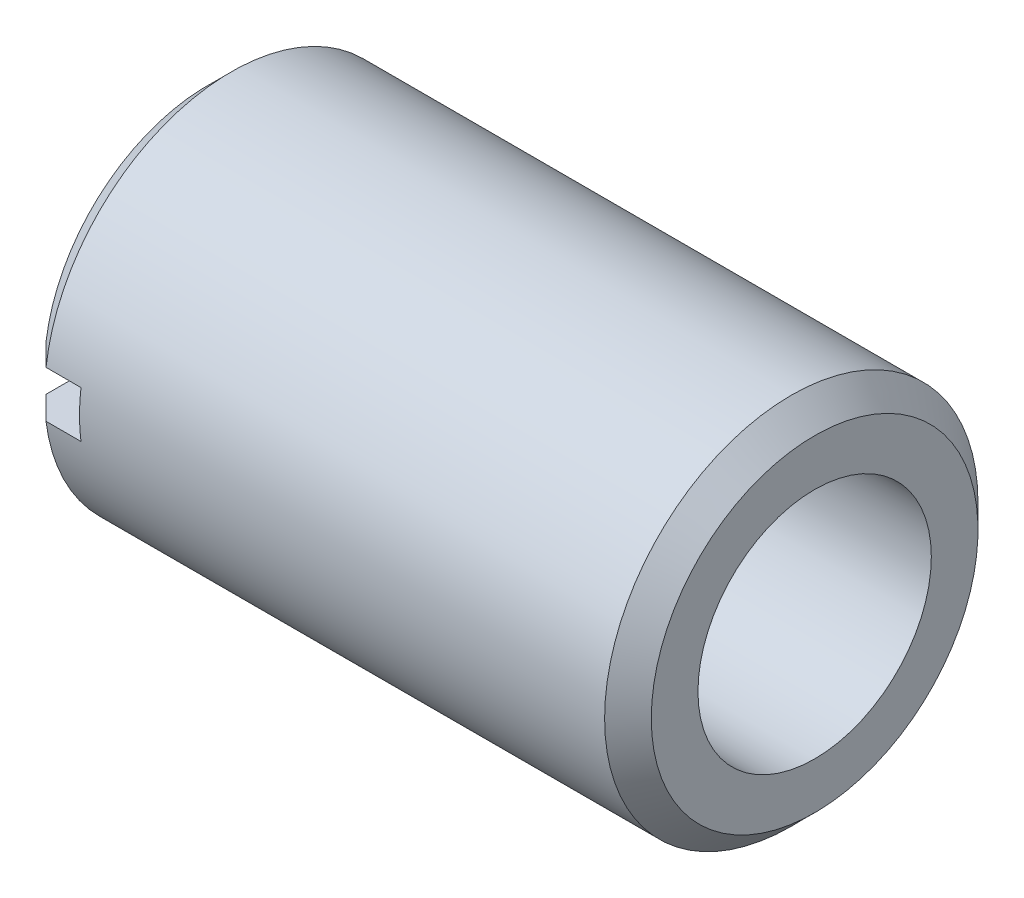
from build123d import *

# Parameters (mm, degrees)
ESQUISSE2_W             = 22.481122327
ESQUISSE2_H             = 2
ENL_V_MAT_EXTRU_1_DEPTH = 2.5
CHANFREIN1_SIZE         = 1


with BuildPart() as part:
    # Esquisse1 → Base-R_volution (revolve)
    with BuildSketch(Plane.XY, mode=Mode.PRIVATE) as base_r_volution_sk:
        Polygon((0, 0), (0, 8), (26, 8), (26, 5), (4, 5), (4, 0), align=None)
    revolve(base_r_volution_sk.sketch.rotate(Axis((0, 0, 0), (1, 0, 0)), 90), axis=Axis((0, 0, 0), (1, 0, 0)))

    # Esquisse2 → Enl_v. mat.-Extru.1 (cut)
    with BuildSketch(Plane.ZY):
        with Locations((0.958048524, 0)):
            Rectangle(ESQUISSE2_W, ESQUISSE2_H)
    extrude(amount=-ENL_V_MAT_EXTRU_1_DEPTH, mode=Mode.SUBTRACT)

    # Chanfrein1
    chanfrein1_edges = [part.edges().sort_by_distance(p)[0] for p in [
        (0, -8, 0),
        (26, 0, -8),
        (0, 8, 0),
    ]]
    chamfer(chanfrein1_edges, length=CHANFREIN1_SIZE)


solid = part.part
